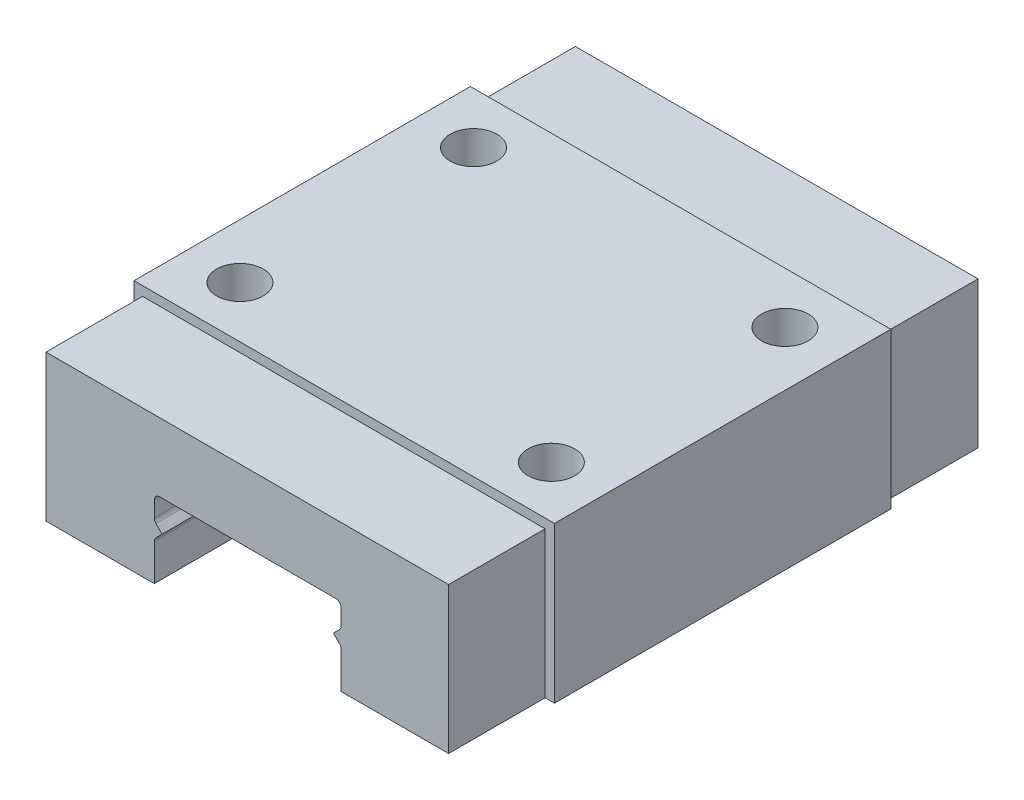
from build123d import *

# Parameters (mm, degrees)
SKETCH1_W            = 27
SKETCH1_H            = 10
EXTRUDE1_DEPTH       = 34
CUT_EXTRUDE1_DEPTH   = 39.823317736
FILLET1_R            = 0.35
FILLET1_OF_MIRROR1_R = 0.35
LPATTERN1_COUNT      = 2
LPATTERN1_PITCH      = 20
LPATTERN1_COUNT_DIR2 = 2
LPATTERN1_PITCH_DIR2 = 15
SKETCH5_OUTSIDE_W    = 37.91
SKETCH5_OUTSIDE_H    = 20.91
SKETCH5_OUTSIDE_W_2  = 25.855665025
SKETCH5_OUTSIDE_H_2  = 9.4
CUT_EXTRUDE2_DEPTH   = 6.2


with BuildPart() as part:
    # Sketch1 → Extrude1 (new body)
    with BuildSketch(Plane.XY):
        with Locations((0, 8)):
            Rectangle(SKETCH1_W, SKETCH1_H)
    extrude(amount=EXTRUDE1_DEPTH)

    # Sketch2 → Cut-Extrude1 (cut, through all)
    with BuildSketch(Plane(origin=(0, 0, 0), x_dir=(-1, 0, 0), z_dir=(0, 0, -1))):
        Polygon((5.5, 6), (6, 5.5), (6, 0.830210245), (0, 0.830210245), (0, 8), (6, 8), (6, 6.5), align=None)
    cut_extrude1 = extrude(amount=-CUT_EXTRUDE1_DEPTH, mode=Mode.SUBTRACT)

    # Fillet1
    fillet1_edges = [part.edges().sort_by_distance(p)[0] for p in [
        (-6, 5.5, 17),
        (-6, 8, 17),
        (-6, 6.5, 17),
    ]]
    fillet(fillet1_edges, radius=FILLET1_R)

    # Mirror1: Cut-Extrude1 across plane
    add(cut_extrude1.mirror(Plane(origin=(0, 0, 0), x_dir=(0, 0, 1), z_dir=(1, 0, 0))), mode=Mode.SUBTRACT)

    # Fillet1 of Mirror1
    fillet1_of_mirror1_edges = [part.edges().sort_by_distance(p)[0] for p in [
        (6, 5.5, 17),
        (6, 8, 17),
        (6, 6.5, 17),
    ]]
    fillet(fillet1_of_mirror1_edges, radius=FILLET1_OF_MIRROR1_R)

    # Sketch3 → M3x0.5 Tapped Hole1 (revolve, cut)
    with BuildSketch(Plane(origin=(-10, 13, 9.5), x_dir=(0, 0, 1), z_dir=(1, 0, 0))):
        Polygon((0, 0), (0, 5.751075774), (1.25, 5), (1.25, 3.5), (1.5, 3.5), (1.5, 0), align=None)
    m3x0_5_tapped_hole1 = revolve(axis=Axis((-10, 19.35, 9.5), (0, -1, 0)), mode=Mode.SUBTRACT)

    # LPattern1: M3x0.5 Tapped Hole1 2 × 2
    with Locations(*[(i * LPATTERN1_PITCH, 0, j * LPATTERN1_PITCH_DIR2) for i in range(LPATTERN1_COUNT) for j in range(LPATTERN1_COUNT_DIR2) if (i, j) != (0, 0)]):
        add(m3x0_5_tapped_hole1, mode=Mode.SUBTRACT)

    # Sketch5 outside → Cut-Extrude2 (cut)
    with BuildSketch(Plane(origin=(0, 0, 0), x_dir=(-1, 0, 0), z_dir=(0, 0, -1))):
        with Locations((0, 8)):
            Rectangle(SKETCH5_OUTSIDE_W, SKETCH5_OUTSIDE_H)
        with Locations((0.027832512, 7.7)):
            Rectangle(SKETCH5_OUTSIDE_W_2, SKETCH5_OUTSIDE_H_2, mode=Mode.SUBTRACT)
    cut_extrude2 = extrude(amount=-CUT_EXTRUDE2_DEPTH, mode=Mode.SUBTRACT)

    # Mirror2: Cut-Extrude2 across plane
    add(cut_extrude2.mirror(Plane.XY.offset(17)), mode=Mode.SUBTRACT)


solid = part.part
